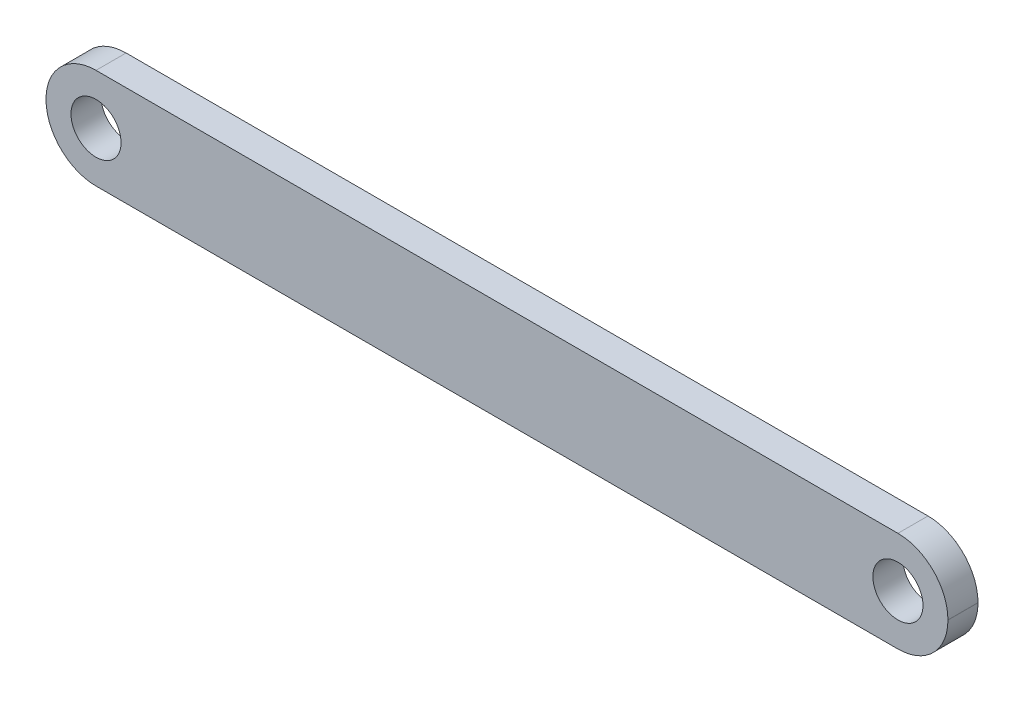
ISO-10303-21;
HEADER;
FILE_DESCRIPTION(('STEP AP214'),'2;1');
FILE_NAME('part.step','',(''),(''),'','','');
FILE_SCHEMA(('AUTOMOTIVE_DESIGN { 1 0 10303 214 1 1 1 1 }'));
ENDSEC;
DATA;
#1=APPLICATION_CONTEXT('core data for automotive mechanical design processes');
#2=APPLICATION_PROTOCOL_DEFINITION('international standard','automotive_design',2000,#1);
#3=PRODUCT_CONTEXT('',#1,'mechanical');
#4=PRODUCT('Part','Part','',(#3));
#5=PRODUCT_RELATED_PRODUCT_CATEGORY('part','',(#4));
#6=PRODUCT_DEFINITION_FORMATION('','',#4);
#7=PRODUCT_DEFINITION_CONTEXT('part definition',#1,'design');
#8=PRODUCT_DEFINITION('design','',#6,#7);
#9=PRODUCT_DEFINITION_SHAPE('','',#8);
#10=(LENGTH_UNIT() NAMED_UNIT(*) SI_UNIT(.MILLI.,.METRE.));
#11=(NAMED_UNIT(*) PLANE_ANGLE_UNIT() SI_UNIT($,.RADIAN.));
#12=(NAMED_UNIT(*) SI_UNIT($,.STERADIAN.) SOLID_ANGLE_UNIT());
#13=UNCERTAINTY_MEASURE_WITH_UNIT(LENGTH_MEASURE(1.E-05),#10,'distance_accuracy_value','');
#14=(GEOMETRIC_REPRESENTATION_CONTEXT(3) GLOBAL_UNCERTAINTY_ASSIGNED_CONTEXT((#13)) GLOBAL_UNIT_ASSIGNED_CONTEXT((#10,
#11,#12)) REPRESENTATION_CONTEXT('',''));
#15=CARTESIAN_POINT('',(0.,0.,0.));
#16=DIRECTION('',(0.,0.,1.));
#17=DIRECTION('',(1.,0.,0.));
#18=AXIS2_PLACEMENT_3D('',#15,#16,#17);
#19=CARTESIAN_POINT('',(-34.9638287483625,8.25729069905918,3.));
#20=DIRECTION('',(0.,0.,-1.));
#21=DIRECTION('',(-1.,0.,0.));
#22=AXIS2_PLACEMENT_3D('',#19,#20,#21);
#23=PLANE('',#22);
#24=CARTESIAN_POINT('',(-34.9638287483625,8.23729069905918,3.));
#25=DIRECTION('',(0.,0.,1.));
#26=DIRECTION('',(1.,0.,0.));
#27=AXIS2_PLACEMENT_3D('',#24,#25,#26);
#28=CIRCLE('',#27,2.5);
#29=CARTESIAN_POINT('',(-32.4638287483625,8.23729069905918,3.));
#30=VERTEX_POINT('',#29);
#31=EDGE_CURVE('E115',#30,#30,#28,.T.);
#32=ORIENTED_EDGE('',*,*,#31,.F.);
#33=EDGE_LOOP('',(#32));
#34=FACE_BOUND('',#33,.T.);
#35=CARTESIAN_POINT('',(-34.9638287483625,8.25729069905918,3.));
#36=DIRECTION('',(0.,0.,1.));
#37=DIRECTION('',(-1.,0.,0.));
#38=AXIS2_PLACEMENT_3D('',#35,#36,#37);
#39=CIRCLE('',#38,4.99);
#40=CARTESIAN_POINT('',(-34.9638287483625,13.2472906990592,3.));
#41=VERTEX_POINT('',#40);
#42=CARTESIAN_POINT('',(-39.9538287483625,8.25729069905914,3.));
#43=VERTEX_POINT('',#42);
#44=EDGE_CURVE('E133',#41,#43,#39,.T.);
#45=ORIENTED_EDGE('',*,*,#44,.T.);
#46=DIRECTION('',(0.,-1.,0.));
#47=VECTOR('',#46,1.);
#48=CARTESIAN_POINT('',(-39.9538287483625,8.25729069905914,3.));
#49=LINE('',#48,#47);
#50=CARTESIAN_POINT('',(-39.9538287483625,8.23729069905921,3.));
#51=VERTEX_POINT('',#50);
#52=EDGE_CURVE('E110',#43,#51,#49,.T.);
#53=ORIENTED_EDGE('',*,*,#52,.T.);
#54=CARTESIAN_POINT('',(-34.9638287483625,8.23729069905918,3.));
#55=DIRECTION('',(0.,0.,1.));
#56=DIRECTION('',(-1.,0.,0.));
#57=AXIS2_PLACEMENT_3D('',#54,#55,#56);
#58=CIRCLE('',#57,4.99);
#59=CARTESIAN_POINT('',(-34.9638287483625,3.24729069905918,3.));
#60=VERTEX_POINT('',#59);
#61=EDGE_CURVE('E136',#51,#60,#58,.T.);
#62=ORIENTED_EDGE('',*,*,#61,.T.);
#63=DIRECTION('',(1.,0.,0.));
#64=VECTOR('',#63,1.);
#65=CARTESIAN_POINT('',(-34.9638287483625,3.24729069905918,3.));
#66=LINE('',#65,#64);
#67=CARTESIAN_POINT('',(45.0561712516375,3.24729069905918,3.));
#68=VERTEX_POINT('',#67);
#69=EDGE_CURVE('E138',#60,#68,#66,.T.);
#70=ORIENTED_EDGE('',*,*,#69,.T.);
#71=CARTESIAN_POINT('',(45.0561712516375,8.23729069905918,3.));
#72=DIRECTION('',(0.,0.,1.));
#73=DIRECTION('',(-1.,0.,0.));
#74=AXIS2_PLACEMENT_3D('',#71,#72,#73);
#75=CIRCLE('',#74,4.99);
#76=CARTESIAN_POINT('',(50.0461712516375,8.23729069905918,3.));
#77=VERTEX_POINT('',#76);
#78=EDGE_CURVE('E140',#68,#77,#75,.T.);
#79=ORIENTED_EDGE('',*,*,#78,.T.);
#80=DIRECTION('',(3.46944695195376E-13,1.,0.));
#81=VECTOR('',#80,1.);
#82=CARTESIAN_POINT('',(50.0461712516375,8.25729069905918,3.));
#83=LINE('',#82,#81);
#84=CARTESIAN_POINT('',(50.0461712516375,8.25729069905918,3.));
#85=VERTEX_POINT('',#84);
#86=EDGE_CURVE('E142',#77,#85,#83,.T.);
#87=ORIENTED_EDGE('',*,*,#86,.T.);
#88=CARTESIAN_POINT('',(45.0561712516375,8.25729069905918,3.));
#89=DIRECTION('',(0.,0.,1.));
#90=DIRECTION('',(-1.,0.,0.));
#91=AXIS2_PLACEMENT_3D('',#88,#89,#90);
#92=CIRCLE('',#91,4.99000000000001);
#93=CARTESIAN_POINT('',(45.0561712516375,13.2472906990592,3.));
#94=VERTEX_POINT('',#93);
#95=EDGE_CURVE('E51',#85,#94,#92,.T.);
#96=ORIENTED_EDGE('',*,*,#95,.T.);
#97=DIRECTION('',(-1.,0.,0.));
#98=VECTOR('',#97,1.);
#99=CARTESIAN_POINT('',(-34.9638287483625,13.2472906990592,3.));
#100=LINE('',#99,#98);
#101=EDGE_CURVE('E46',#94,#41,#100,.T.);
#102=ORIENTED_EDGE('',*,*,#101,.T.);
#103=EDGE_LOOP('',(#45,#53,#62,#70,#79,#87,#96,#102));
#104=FACE_BOUND('',#103,.T.);
#105=CARTESIAN_POINT('',(45.0561712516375,8.25729069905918,3.));
#106=DIRECTION('',(0.,0.,1.));
#107=DIRECTION('',(1.,0.,0.));
#108=AXIS2_PLACEMENT_3D('',#105,#106,#107);
#109=CIRCLE('',#108,2.49999999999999);
#110=CARTESIAN_POINT('',(47.5561712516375,8.25729069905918,3.));
#111=VERTEX_POINT('',#110);
#112=EDGE_CURVE('E213',#111,#111,#109,.T.);
#113=ORIENTED_EDGE('',*,*,#112,.F.);
#114=EDGE_LOOP('',(#113));
#115=FACE_BOUND('',#114,.T.);
#116=ADVANCED_FACE('F31',(#34,#104,#115),#23,.F.);
#117=CARTESIAN_POINT('',(-34.9638287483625,8.25729069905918,0.));
#118=DIRECTION('',(0.,0.,-1.));
#119=DIRECTION('',(-1.,0.,0.));
#120=AXIS2_PLACEMENT_3D('',#117,#118,#119);
#121=PLANE('',#120);
#122=CARTESIAN_POINT('',(-34.9638287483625,8.23729069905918,0.));
#123=DIRECTION('',(0.,0.,1.));
#124=DIRECTION('',(1.,0.,0.));
#125=AXIS2_PLACEMENT_3D('',#122,#123,#124);
#126=CIRCLE('',#125,2.5);
#127=CARTESIAN_POINT('',(-32.4638287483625,8.23729069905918,0.));
#128=VERTEX_POINT('',#127);
#129=EDGE_CURVE('E118',#128,#128,#126,.T.);
#130=ORIENTED_EDGE('',*,*,#129,.T.);
#131=EDGE_LOOP('',(#130));
#132=FACE_BOUND('',#131,.T.);
#133=CARTESIAN_POINT('',(-34.9638287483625,8.25729069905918,0.));
#134=DIRECTION('',(0.,0.,1.));
#135=DIRECTION('',(-1.,0.,0.));
#136=AXIS2_PLACEMENT_3D('',#133,#134,#135);
#137=CIRCLE('',#136,4.99);
#138=CARTESIAN_POINT('',(-34.9638287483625,13.2472906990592,0.));
#139=VERTEX_POINT('',#138);
#140=CARTESIAN_POINT('',(-39.9538287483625,8.25729069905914,0.));
#141=VERTEX_POINT('',#140);
#142=EDGE_CURVE('E101',#139,#141,#137,.T.);
#143=ORIENTED_EDGE('',*,*,#142,.F.);
#144=DIRECTION('',(-1.,0.,0.));
#145=VECTOR('',#144,1.);
#146=CARTESIAN_POINT('',(-34.9638287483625,13.2472906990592,0.));
#147=LINE('',#146,#145);
#148=CARTESIAN_POINT('',(45.0561712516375,13.2472906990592,0.));
#149=VERTEX_POINT('',#148);
#150=EDGE_CURVE('E131',#149,#139,#147,.T.);
#151=ORIENTED_EDGE('',*,*,#150,.F.);
#152=CARTESIAN_POINT('',(45.0561712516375,8.25729069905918,0.));
#153=DIRECTION('',(0.,0.,1.));
#154=DIRECTION('',(-1.,0.,0.));
#155=AXIS2_PLACEMENT_3D('',#152,#153,#154);
#156=CIRCLE('',#155,4.99000000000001);
#157=CARTESIAN_POINT('',(50.0461712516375,8.25729069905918,0.));
#158=VERTEX_POINT('',#157);
#159=EDGE_CURVE('E129',#158,#149,#156,.T.);
#160=ORIENTED_EDGE('',*,*,#159,.F.);
#161=DIRECTION('',(3.46944695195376E-13,1.,0.));
#162=VECTOR('',#161,1.);
#163=CARTESIAN_POINT('',(50.0461712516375,8.25729069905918,0.));
#164=LINE('',#163,#162);
#165=CARTESIAN_POINT('',(50.0461712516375,8.23729069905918,0.));
#166=VERTEX_POINT('',#165);
#167=EDGE_CURVE('E127',#166,#158,#164,.T.);
#168=ORIENTED_EDGE('',*,*,#167,.F.);
#169=CARTESIAN_POINT('',(45.0561712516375,8.23729069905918,0.));
#170=DIRECTION('',(0.,0.,1.));
#171=DIRECTION('',(-1.,0.,0.));
#172=AXIS2_PLACEMENT_3D('',#169,#170,#171);
#173=CIRCLE('',#172,4.99);
#174=CARTESIAN_POINT('',(45.0561712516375,3.24729069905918,0.));
#175=VERTEX_POINT('',#174);
#176=EDGE_CURVE('E125',#175,#166,#173,.T.);
#177=ORIENTED_EDGE('',*,*,#176,.F.);
#178=DIRECTION('',(1.,0.,0.));
#179=VECTOR('',#178,1.);
#180=CARTESIAN_POINT('',(-34.9638287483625,3.24729069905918,0.));
#181=LINE('',#180,#179);
#182=CARTESIAN_POINT('',(-34.9638287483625,3.24729069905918,0.));
#183=VERTEX_POINT('',#182);
#184=EDGE_CURVE('E123',#183,#175,#181,.T.);
#185=ORIENTED_EDGE('',*,*,#184,.F.);
#186=CARTESIAN_POINT('',(-34.9638287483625,8.23729069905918,0.));
#187=DIRECTION('',(0.,0.,1.));
#188=DIRECTION('',(-1.,0.,0.));
#189=AXIS2_PLACEMENT_3D('',#186,#187,#188);
#190=CIRCLE('',#189,4.99);
#191=CARTESIAN_POINT('',(-39.9538287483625,8.23729069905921,0.));
#192=VERTEX_POINT('',#191);
#193=EDGE_CURVE('E103',#192,#183,#190,.T.);
#194=ORIENTED_EDGE('',*,*,#193,.F.);
#195=DIRECTION('',(0.,-1.,0.));
#196=VECTOR('',#195,1.);
#197=CARTESIAN_POINT('',(-39.9538287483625,8.25729069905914,0.));
#198=LINE('',#197,#196);
#199=EDGE_CURVE('E96',#141,#192,#198,.T.);
#200=ORIENTED_EDGE('',*,*,#199,.F.);
#201=EDGE_LOOP('',(#143,#151,#160,#168,#177,#185,#194,#200));
#202=FACE_BOUND('',#201,.T.);
#203=CARTESIAN_POINT('',(45.0561712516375,8.25729069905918,0.));
#204=DIRECTION('',(0.,0.,1.));
#205=DIRECTION('',(1.,0.,0.));
#206=AXIS2_PLACEMENT_3D('',#203,#204,#205);
#207=CIRCLE('',#206,2.49999999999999);
#208=CARTESIAN_POINT('',(47.5561712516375,8.25729069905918,0.));
#209=VERTEX_POINT('',#208);
#210=EDGE_CURVE('E216',#209,#209,#207,.T.);
#211=ORIENTED_EDGE('',*,*,#210,.T.);
#212=EDGE_LOOP('',(#211));
#213=FACE_BOUND('',#212,.T.);
#214=ADVANCED_FACE('F97',(#132,#202,#213),#121,.T.);
#215=CARTESIAN_POINT('',(-34.9638287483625,8.25729069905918,3.));
#216=DIRECTION('',(0.,0.,-1.));
#217=DIRECTION('',(-1.,0.,0.));
#218=AXIS2_PLACEMENT_3D('',#215,#216,#217);
#219=CYLINDRICAL_SURFACE('',#218,4.99);
#220=ORIENTED_EDGE('',*,*,#142,.T.);
#221=DIRECTION('',(0.,0.,-1.));
#222=VECTOR('',#221,1.);
#223=CARTESIAN_POINT('',(-39.9538287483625,8.25729069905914,3.));
#224=LINE('',#223,#222);
#225=EDGE_CURVE('E11',#43,#141,#224,.T.);
#226=ORIENTED_EDGE('',*,*,#225,.F.);
#227=ORIENTED_EDGE('',*,*,#44,.F.);
#228=DIRECTION('',(0.,0.,-1.));
#229=VECTOR('',#228,1.);
#230=CARTESIAN_POINT('',(-34.9638287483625,13.2472906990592,3.));
#231=LINE('',#230,#229);
#232=EDGE_CURVE('E114',#41,#139,#231,.T.);
#233=ORIENTED_EDGE('',*,*,#232,.T.);
#234=EDGE_LOOP('',(#220,#226,#227,#233));
#235=FACE_BOUND('',#234,.T.);
#236=ADVANCED_FACE('F33',(#235),#219,.T.);
#237=CARTESIAN_POINT('',(-39.9538287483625,8.25729069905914,3.));
#238=DIRECTION('',(1.,0.,0.));
#239=DIRECTION('',(0.,0.,-1.));
#240=AXIS2_PLACEMENT_3D('',#237,#238,#239);
#241=PLANE('',#240);
#242=ORIENTED_EDGE('',*,*,#199,.T.);
#243=DIRECTION('',(0.,0.,-1.));
#244=VECTOR('',#243,1.);
#245=CARTESIAN_POINT('',(-39.9538287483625,8.23729069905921,3.));
#246=LINE('',#245,#244);
#247=EDGE_CURVE('E39',#51,#192,#246,.T.);
#248=ORIENTED_EDGE('',*,*,#247,.F.);
#249=ORIENTED_EDGE('',*,*,#52,.F.);
#250=ORIENTED_EDGE('',*,*,#225,.T.);
#251=EDGE_LOOP('',(#242,#248,#249,#250));
#252=FACE_BOUND('',#251,.T.);
#253=ADVANCED_FACE('F109',(#252),#241,.F.);
#254=CARTESIAN_POINT('',(-34.9638287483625,8.23729069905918,3.));
#255=DIRECTION('',(0.,0.,-1.));
#256=DIRECTION('',(-1.,0.,0.));
#257=AXIS2_PLACEMENT_3D('',#254,#255,#256);
#258=CYLINDRICAL_SURFACE('',#257,4.99);
#259=ORIENTED_EDGE('',*,*,#193,.T.);
#260=DIRECTION('',(0.,0.,-1.));
#261=VECTOR('',#260,1.);
#262=CARTESIAN_POINT('',(-34.9638287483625,3.24729069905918,3.));
#263=LINE('',#262,#261);
#264=EDGE_CURVE('E159',#60,#183,#263,.T.);
#265=ORIENTED_EDGE('',*,*,#264,.F.);
#266=ORIENTED_EDGE('',*,*,#61,.F.);
#267=ORIENTED_EDGE('',*,*,#247,.T.);
#268=EDGE_LOOP('',(#259,#265,#266,#267));
#269=FACE_BOUND('',#268,.T.);
#270=ADVANCED_FACE('F163',(#269),#258,.T.);
#271=CARTESIAN_POINT('',(-34.9638287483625,3.24729069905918,3.));
#272=DIRECTION('',(0.,1.,0.));
#273=DIRECTION('',(-1.,0.,0.));
#274=AXIS2_PLACEMENT_3D('',#271,#272,#273);
#275=PLANE('',#274);
#276=ORIENTED_EDGE('',*,*,#184,.T.);
#277=DIRECTION('',(0.,0.,-1.));
#278=VECTOR('',#277,1.);
#279=CARTESIAN_POINT('',(45.0561712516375,3.24729069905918,3.));
#280=LINE('',#279,#278);
#281=EDGE_CURVE('E156',#68,#175,#280,.T.);
#282=ORIENTED_EDGE('',*,*,#281,.F.);
#283=ORIENTED_EDGE('',*,*,#69,.F.);
#284=ORIENTED_EDGE('',*,*,#264,.T.);
#285=EDGE_LOOP('',(#276,#282,#283,#284));
#286=FACE_BOUND('',#285,.T.);
#287=ADVANCED_FACE('F171',(#286),#275,.F.);
#288=CARTESIAN_POINT('',(45.0561712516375,8.23729069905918,3.));
#289=DIRECTION('',(0.,0.,-1.));
#290=DIRECTION('',(-1.,0.,0.));
#291=AXIS2_PLACEMENT_3D('',#288,#289,#290);
#292=CYLINDRICAL_SURFACE('',#291,4.99);
#293=ORIENTED_EDGE('',*,*,#176,.T.);
#294=DIRECTION('',(0.,0.,-1.));
#295=VECTOR('',#294,1.);
#296=CARTESIAN_POINT('',(50.0461712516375,8.23729069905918,3.));
#297=LINE('',#296,#295);
#298=EDGE_CURVE('E153',#77,#166,#297,.T.);
#299=ORIENTED_EDGE('',*,*,#298,.F.);
#300=ORIENTED_EDGE('',*,*,#78,.F.);
#301=ORIENTED_EDGE('',*,*,#281,.T.);
#302=EDGE_LOOP('',(#293,#299,#300,#301));
#303=FACE_BOUND('',#302,.T.);
#304=ADVANCED_FACE('F174',(#303),#292,.T.);
#305=CARTESIAN_POINT('',(50.0461712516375,8.25729069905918,3.));
#306=DIRECTION('',(-1.,3.46944695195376E-13,0.));
#307=DIRECTION('',(-3.46944695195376E-13,-1.,0.));
#308=AXIS2_PLACEMENT_3D('',#305,#306,#307);
#309=PLANE('',#308);
#310=ORIENTED_EDGE('',*,*,#167,.T.);
#311=DIRECTION('',(0.,0.,-1.));
#312=VECTOR('',#311,1.);
#313=CARTESIAN_POINT('',(50.0461712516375,8.25729069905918,3.));
#314=LINE('',#313,#312);
#315=EDGE_CURVE('E150',#85,#158,#314,.T.);
#316=ORIENTED_EDGE('',*,*,#315,.F.);
#317=ORIENTED_EDGE('',*,*,#86,.F.);
#318=ORIENTED_EDGE('',*,*,#298,.T.);
#319=EDGE_LOOP('',(#310,#316,#317,#318));
#320=FACE_BOUND('',#319,.T.);
#321=ADVANCED_FACE('F179',(#320),#309,.F.);
#322=CARTESIAN_POINT('',(45.0561712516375,8.25729069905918,3.));
#323=DIRECTION('',(0.,0.,-1.));
#324=DIRECTION('',(-1.,0.,0.));
#325=AXIS2_PLACEMENT_3D('',#322,#323,#324);
#326=CYLINDRICAL_SURFACE('',#325,4.99000000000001);
#327=ORIENTED_EDGE('',*,*,#159,.T.);
#328=DIRECTION('',(0.,0.,-1.));
#329=VECTOR('',#328,1.);
#330=CARTESIAN_POINT('',(45.0561712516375,13.2472906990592,3.));
#331=LINE('',#330,#329);
#332=EDGE_CURVE('E147',#94,#149,#331,.T.);
#333=ORIENTED_EDGE('',*,*,#332,.F.);
#334=ORIENTED_EDGE('',*,*,#95,.F.);
#335=ORIENTED_EDGE('',*,*,#315,.T.);
#336=EDGE_LOOP('',(#327,#333,#334,#335));
#337=FACE_BOUND('',#336,.T.);
#338=ADVANCED_FACE('F182',(#337),#326,.T.);
#339=CARTESIAN_POINT('',(-34.9638287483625,13.2472906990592,3.));
#340=DIRECTION('',(0.,-1.,0.));
#341=DIRECTION('',(0.,0.,-1.));
#342=AXIS2_PLACEMENT_3D('',#339,#340,#341);
#343=PLANE('',#342);
#344=ORIENTED_EDGE('',*,*,#150,.T.);
#345=ORIENTED_EDGE('',*,*,#232,.F.);
#346=ORIENTED_EDGE('',*,*,#101,.F.);
#347=ORIENTED_EDGE('',*,*,#332,.T.);
#348=EDGE_LOOP('',(#344,#345,#346,#347));
#349=FACE_BOUND('',#348,.T.);
#350=ADVANCED_FACE('F184',(#349),#343,.F.);
#351=CARTESIAN_POINT('',(-34.9638287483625,8.23729069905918,3.));
#352=DIRECTION('',(0.,0.,-1.));
#353=DIRECTION('',(-1.,0.,0.));
#354=AXIS2_PLACEMENT_3D('',#351,#352,#353);
#355=CYLINDRICAL_SURFACE('',#354,2.5);
#356=ORIENTED_EDGE('',*,*,#31,.T.);
#357=EDGE_LOOP('',(#356));
#358=FACE_BOUND('',#357,.T.);
#359=ORIENTED_EDGE('',*,*,#129,.F.);
#360=EDGE_LOOP('',(#359));
#361=FACE_BOUND('',#360,.T.);
#362=ADVANCED_FACE('F186',(#358,#361),#355,.F.);
#363=CARTESIAN_POINT('',(45.0561712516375,8.25729069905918,3.));
#364=DIRECTION('',(0.,0.,-1.));
#365=DIRECTION('',(-1.,0.,0.));
#366=AXIS2_PLACEMENT_3D('',#363,#364,#365);
#367=CYLINDRICAL_SURFACE('',#366,2.49999999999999);
#368=ORIENTED_EDGE('',*,*,#112,.T.);
#369=EDGE_LOOP('',(#368));
#370=FACE_BOUND('',#369,.T.);
#371=ORIENTED_EDGE('',*,*,#210,.F.);
#372=EDGE_LOOP('',(#371));
#373=FACE_BOUND('',#372,.T.);
#374=ADVANCED_FACE('F192',(#370,#373),#367,.F.);
#375=CLOSED_SHELL('',(#116,#214,#236,#253,#270,#287,#304,#321,#338,#350,#362,#374));
#376=MANIFOLD_SOLID_BREP('B2',#375);
#377=ADVANCED_BREP_SHAPE_REPRESENTATION('',(#18,#376),#14);
#378=SHAPE_DEFINITION_REPRESENTATION(#9,#377);
ENDSEC;
END-ISO-10303-21;
